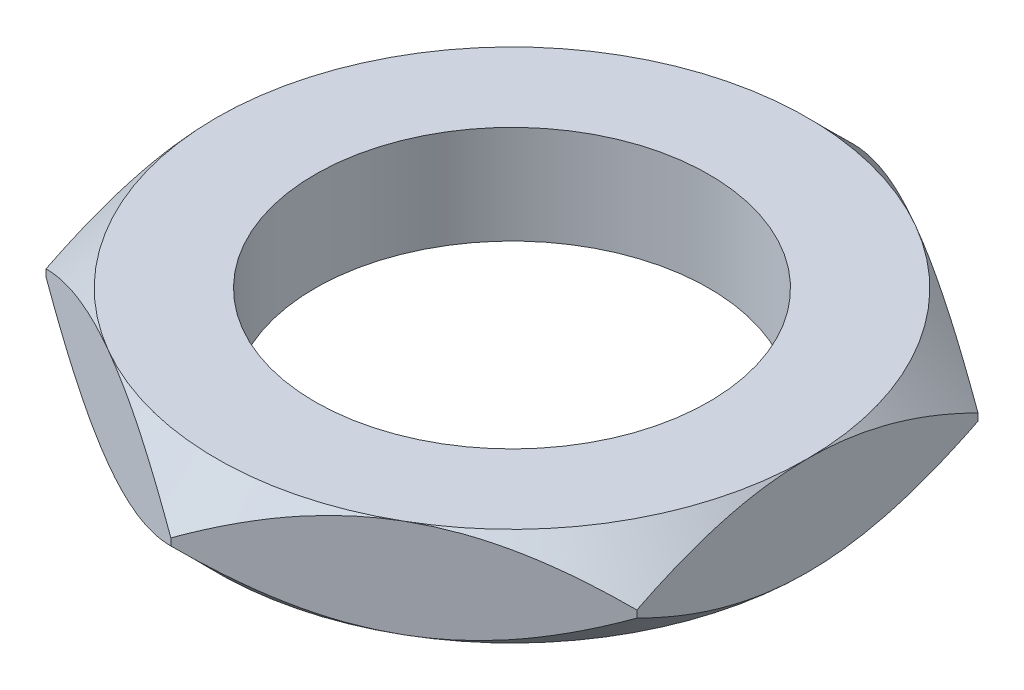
from build123d import *

# Parameters (mm, degrees)
ESQUISSE1_R             = 3
BASE_EXTRUSION_DEPTH    = 1.5
ESQUISSE3_OUTSIDE_W     = 29.838
ESQUISSE3_OUTSIDE_H     = 31.23
ESQUISSE3_OUTSIDE_R     = 4.5
ENL_V_MAT_EXTRU_7_DEPTH = 8.03562364
ENL_V_MAT_EXTRU_7_DRAFT = -45
ESQUISSE4_OUTSIDE_W     = 29.838
ESQUISSE4_OUTSIDE_H     = 31.23
ESQUISSE4_OUTSIDE_R     = 4.5
ENL_V_MAT_EXTRU_8_DEPTH = 8.03562364
ENL_V_MAT_EXTRU_8_DRAFT = -45


with BuildPart() as part:
    # Esquisse1 → Base-Extrusion (new body)
    with BuildSketch(Plane(origin=(0, 0, 0), x_dir=(1, 0, 0), z_dir=(0, 1, 0))):
        Polygon((0, 5.196152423), (-4.5, 2.598076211), (-4.5, -2.598076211), (0, -5.196152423), (4.5, -2.598076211), (4.5, 2.598076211), align=None)
        with Locations(Location((0, 0, 0), (0, 0, 270))):
            Circle(ESQUISSE1_R, mode=Mode.SUBTRACT)
    extrude(amount=BASE_EXTRUSION_DEPTH)


with BuildPart() as enl_v_mat_extru_7_tool:
    # Esquisse3 outside → Enl_v. mat.-Extru.7 (with draft: the straight prism first)
    with BuildSketch(Plane(origin=(0, 1.5, 0), x_dir=(-1, 0, 0), z_dir=(0, 1, 0))):
        Rectangle(ESQUISSE3_OUTSIDE_W, ESQUISSE3_OUTSIDE_H)
        Circle(ESQUISSE3_OUTSIDE_R, mode=Mode.SUBTRACT)
    extrude(amount=-ENL_V_MAT_EXTRU_7_DEPTH)
    # Enl_v. mat.-Extru.7: the draft: its side faces are tilted about the plane it starts from
    enl_v_mat_extru_7_sides = [enl_v_mat_extru_7_tool.faces().sort_by_distance(p)[0] for p in [
        (0, -2.51781182, -15.615),
        (-14.919, -2.51781182, 0),
        (0, -2.51781182, 15.615),
        (14.919, -2.51781182, 0),
        (4.5, -2.51781182, 0),
    ]]
    draft(enl_v_mat_extru_7_sides, Plane(origin=(0, 1.5, 0), x_dir=(-1, 0, 0), z_dir=(0, 1, 0)), ENL_V_MAT_EXTRU_7_DRAFT)


with BuildPart() as part_1:
    add(part.part)

    # Enl_v. mat.-Extru.7: cut by enl_v_mat_extru_7_tool
    add(enl_v_mat_extru_7_tool.part, mode=Mode.SUBTRACT)


with BuildPart() as enl_v_mat_extru_8_tool:
    # Esquisse4 outside → Enl_v. mat.-Extru.8 (with draft: the straight prism first)
    with BuildSketch(Plane.XZ):
        Rectangle(ESQUISSE4_OUTSIDE_W, ESQUISSE4_OUTSIDE_H)
        Circle(ESQUISSE4_OUTSIDE_R, mode=Mode.SUBTRACT)
    extrude(amount=-ENL_V_MAT_EXTRU_8_DEPTH)
    # Enl_v. mat.-Extru.8: the draft: its side faces are tilted about the plane it starts from
    enl_v_mat_extru_8_sides = [enl_v_mat_extru_8_tool.faces().sort_by_distance(p)[0] for p in [
        (0, 4.01781182, -15.615),
        (14.919, 4.01781182, 0),
        (0, 4.01781182, 15.615),
        (-14.919, 4.01781182, 0),
        (-4.5, 4.01781182, 0),
    ]]
    draft(enl_v_mat_extru_8_sides, Plane.XZ, ENL_V_MAT_EXTRU_8_DRAFT)


with BuildPart() as part_2:
    add(part_1.part)

    # Enl_v. mat.-Extru.8: cut by enl_v_mat_extru_8_tool
    add(enl_v_mat_extru_8_tool.part, mode=Mode.SUBTRACT)


solid = part_2.part
